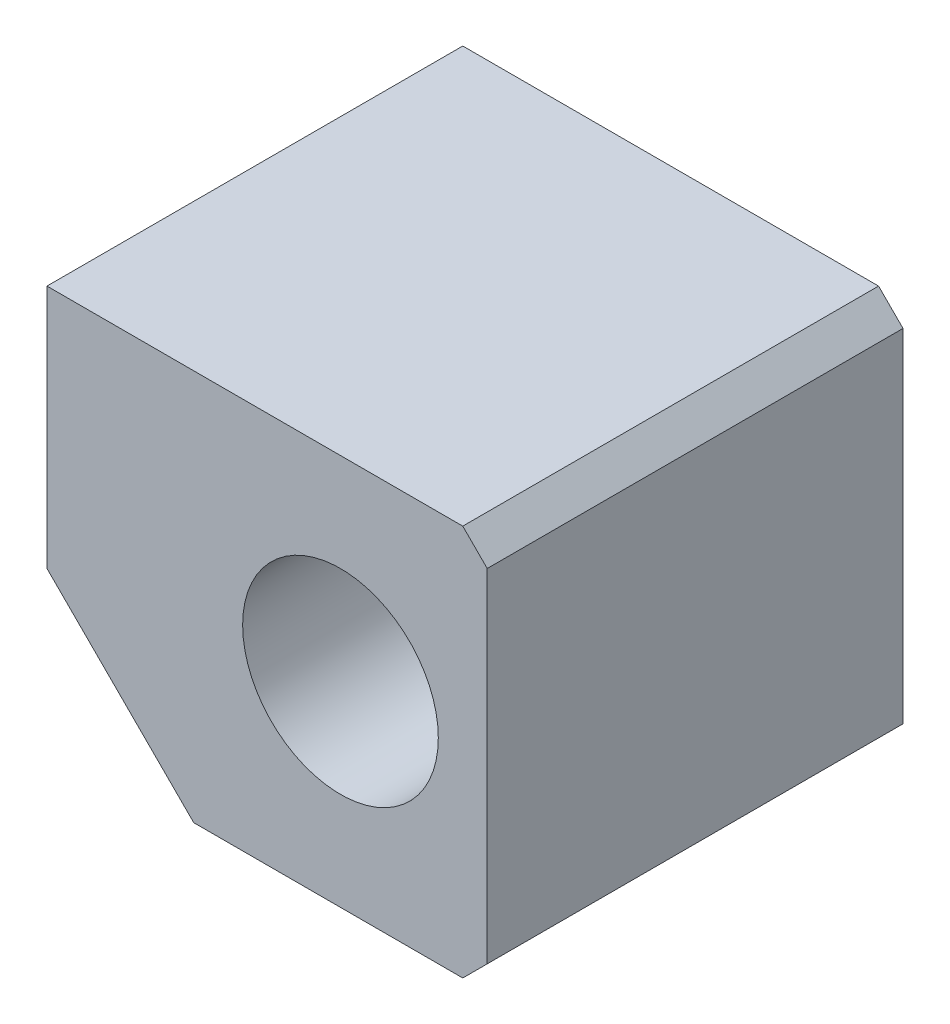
ISO-10303-21;
HEADER;
FILE_DESCRIPTION(('STEP AP214'),'2;1');
FILE_NAME('part.step','',(''),(''),'','','');
FILE_SCHEMA(('AUTOMOTIVE_DESIGN { 1 0 10303 214 1 1 1 1 }'));
ENDSEC;
DATA;
#1=APPLICATION_CONTEXT('core data for automotive mechanical design processes');
#2=APPLICATION_PROTOCOL_DEFINITION('international standard','automotive_design',2000,#1);
#3=PRODUCT_CONTEXT('',#1,'mechanical');
#4=PRODUCT('Part','Part','',(#3));
#5=PRODUCT_RELATED_PRODUCT_CATEGORY('part','',(#4));
#6=PRODUCT_DEFINITION_FORMATION('','',#4);
#7=PRODUCT_DEFINITION_CONTEXT('part definition',#1,'design');
#8=PRODUCT_DEFINITION('design','',#6,#7);
#9=PRODUCT_DEFINITION_SHAPE('','',#8);
#10=(LENGTH_UNIT() NAMED_UNIT(*) SI_UNIT(.MILLI.,.METRE.));
#11=(NAMED_UNIT(*) PLANE_ANGLE_UNIT() SI_UNIT($,.RADIAN.));
#12=(NAMED_UNIT(*) SI_UNIT($,.STERADIAN.) SOLID_ANGLE_UNIT());
#13=UNCERTAINTY_MEASURE_WITH_UNIT(LENGTH_MEASURE(1.E-05),#10,'distance_accuracy_value','');
#14=(GEOMETRIC_REPRESENTATION_CONTEXT(3) GLOBAL_UNCERTAINTY_ASSIGNED_CONTEXT((#13)) GLOBAL_UNIT_ASSIGNED_CONTEXT((#10,
#11,#12)) REPRESENTATION_CONTEXT('',''));
#15=CARTESIAN_POINT('',(0.,0.,0.));
#16=DIRECTION('',(0.,0.,1.));
#17=DIRECTION('',(1.,0.,0.));
#18=AXIS2_PLACEMENT_3D('',#15,#16,#17);
#19=CARTESIAN_POINT('',(40.7365441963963,-61.0198306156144,40.));
#20=DIRECTION('',(0.,1.,0.));
#21=DIRECTION('',(0.,0.,1.));
#22=AXIS2_PLACEMENT_3D('',#19,#20,#21);
#23=CYLINDRICAL_SURFACE('',#22,5.05299999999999);
#24=CARTESIAN_POINT('',(40.7365441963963,-61.0198306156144,40.));
#25=DIRECTION('',(0.,1.,0.));
#26=DIRECTION('',(0.,0.,1.));
#27=AXIS2_PLACEMENT_3D('',#24,#25,#26);
#28=CIRCLE('',#27,5.05299999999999);
#29=CARTESIAN_POINT('',(40.7365441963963,-61.0198306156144,45.053));
#30=VERTEX_POINT('',#29);
#31=EDGE_CURVE('E21',#30,#30,#28,.T.);
#32=ORIENTED_EDGE('',*,*,#31,.F.);
#33=EDGE_LOOP('',(#32));
#34=FACE_BOUND('',#33,.T.);
#35=CARTESIAN_POINT('',(35.6835441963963,-40.3709853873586,40.));
#36=CARTESIAN_POINT('',(35.6835447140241,-40.3709857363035,40.1393591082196));
#37=CARTESIAN_POINT('',(35.6893142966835,-40.3724948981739,40.2787303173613));
#38=CARTESIAN_POINT('',(35.7123485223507,-40.3784875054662,40.5565079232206));
#39=CARTESIAN_POINT('',(35.7296180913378,-40.3829722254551,40.6949138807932));
#40=CARTESIAN_POINT('',(35.7755418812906,-40.3947891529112,40.9699101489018));
#41=CARTESIAN_POINT('',(35.8042127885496,-40.4021255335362,41.1064974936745));
#42=CARTESIAN_POINT('',(35.8727118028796,-40.4194280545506,41.3767283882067));
#43=CARTESIAN_POINT('',(35.9125442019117,-40.4293952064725,41.510370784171));
#44=CARTESIAN_POINT('',(36.0029388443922,-40.4516380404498,41.7734404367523));
#45=CARTESIAN_POINT('',(36.053476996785,-40.463908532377,41.9028764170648));
#46=CARTESIAN_POINT('',(36.1649684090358,-40.490423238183,42.1570274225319));
#47=CARTESIAN_POINT('',(36.225925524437,-40.5046681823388,42.2817406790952));
#48=CARTESIAN_POINT('',(36.357753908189,-40.5347162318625,42.5255084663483));
#49=CARTESIAN_POINT('',(36.4286187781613,-40.5505183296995,42.6445665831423));
#50=CARTESIAN_POINT('',(36.5798276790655,-40.5832580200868,42.8764000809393));
#51=CARTESIAN_POINT('',(36.6601752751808,-40.6001960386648,42.9891730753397));
#52=CARTESIAN_POINT('',(36.8314943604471,-40.635089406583,43.2098750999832));
#53=CARTESIAN_POINT('',(36.9226464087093,-40.6530583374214,43.3176618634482));
#54=CARTESIAN_POINT('',(37.1136608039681,-40.6892018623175,43.5252557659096));
#55=CARTESIAN_POINT('',(37.2135263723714,-40.7073765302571,43.6250599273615));
#56=CARTESIAN_POINT('',(37.4212640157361,-40.7434212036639,43.8159693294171));
#57=CARTESIAN_POINT('',(37.52913436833,-40.7612912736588,43.9070764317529));
#58=CARTESIAN_POINT('',(37.7522414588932,-40.7962481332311,44.0800339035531));
#59=CARTESIAN_POINT('',(37.8674808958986,-40.8133346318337,44.1618808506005));
#60=CARTESIAN_POINT('',(38.10619192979,-40.8464784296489,44.3167787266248));
#61=CARTESIAN_POINT('',(38.2297557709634,-40.862518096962,44.38969139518));
#62=CARTESIAN_POINT('',(38.4828501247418,-40.8928554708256,44.5248496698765));
#63=CARTESIAN_POINT('',(38.6123828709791,-40.9071525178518,44.5870912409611));
#64=CARTESIAN_POINT('',(38.8764143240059,-40.9335818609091,44.7003551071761));
#65=CARTESIAN_POINT('',(39.0109105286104,-40.9457152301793,44.7513829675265));
#66=CARTESIAN_POINT('',(39.2839556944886,-40.9674823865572,44.8418510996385));
#67=CARTESIAN_POINT('',(39.4225060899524,-40.9771152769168,44.8812872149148));
#68=CARTESIAN_POINT('',(39.8368269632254,-41.0014609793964,44.9802206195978));
#69=CARTESIAN_POINT('',(40.117094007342,-41.012220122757,45.0228284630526));
#70=CARTESIAN_POINT('',(40.6808353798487,-41.0217427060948,45.0605933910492));
#71=CARTESIAN_POINT('',(40.9643092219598,-41.0205079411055,45.0557575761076));
#72=CARTESIAN_POINT('',(41.5198069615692,-41.0063745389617,44.9995445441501));
#73=CARTESIAN_POINT('',(41.7919447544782,-40.9937408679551,44.9492245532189));
#74=CARTESIAN_POINT('',(42.3237787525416,-40.9585308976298,44.8051445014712));
#75=CARTESIAN_POINT('',(42.5834742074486,-40.9359539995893,44.7113818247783));
#76=CARTESIAN_POINT('',(43.0858106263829,-40.8829976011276,44.4822670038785));
#77=CARTESIAN_POINT('',(43.3282724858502,-40.8525481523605,44.346539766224));
#78=CARTESIAN_POINT('',(43.7874231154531,-40.7871255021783,44.0375057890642));
#79=CARTESIAN_POINT('',(44.0041090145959,-40.7521517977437,43.8641948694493));
#80=CARTESIAN_POINT('',(44.3082999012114,-40.6985914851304,43.5770959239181));
#81=CARTESIAN_POINT('',(44.4074284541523,-40.6802966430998,43.475285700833));
#82=CARTESIAN_POINT('',(44.596780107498,-40.6439955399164,43.2636656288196));
#83=CARTESIAN_POINT('',(44.6870063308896,-40.6259891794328,43.1538586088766));
#84=CARTESIAN_POINT('',(44.8580104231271,-40.5907568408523,42.9268657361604));
#85=CARTESIAN_POINT('',(44.9387803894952,-40.5735315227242,42.8096738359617));
#86=CARTESIAN_POINT('',(45.0901938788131,-40.5403771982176,42.5688067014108));
#87=CARTESIAN_POINT('',(45.1608413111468,-40.5244476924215,42.4451339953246));
#88=CARTESIAN_POINT('',(45.2919278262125,-40.4942506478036,42.191305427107));
#89=CARTESIAN_POINT('',(45.3523005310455,-40.4799940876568,42.0611139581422));
#90=CARTESIAN_POINT('',(45.4617984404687,-40.4536965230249,41.7959260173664));
#91=CARTESIAN_POINT('',(45.5109281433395,-40.441654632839,41.6609314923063));
#92=CARTESIAN_POINT('',(45.5974906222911,-40.4201704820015,41.3872884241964));
#93=CARTESIAN_POINT('',(45.634942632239,-40.410723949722,41.2486463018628));
#94=CARTESIAN_POINT('',(45.6979210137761,-40.3947060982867,40.9685744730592));
#95=CARTESIAN_POINT('',(45.7234529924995,-40.3881334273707,40.8271461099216));
#96=CARTESIAN_POINT('',(45.7584319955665,-40.3790891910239,40.5714513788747));
#97=CARTESIAN_POINT('',(45.7700926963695,-40.3760558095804,40.4575023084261));
#98=CARTESIAN_POINT('',(45.7856490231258,-40.3720037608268,40.2290382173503));
#99=CARTESIAN_POINT('',(45.7895446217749,-40.370985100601,40.1145231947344));
#100=CARTESIAN_POINT('',(45.7895436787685,-40.3709857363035,39.8606408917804));
#101=CARTESIAN_POINT('',(45.7837740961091,-40.3724948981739,39.7212696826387));
#102=CARTESIAN_POINT('',(45.760739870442,-40.3784875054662,39.4434920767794));
#103=CARTESIAN_POINT('',(45.7434703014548,-40.3829722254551,39.3050861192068));
#104=CARTESIAN_POINT('',(45.697546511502,-40.3947891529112,39.0300898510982));
#105=CARTESIAN_POINT('',(45.668875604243,-40.4021255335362,38.8935025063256));
#106=CARTESIAN_POINT('',(45.600376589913,-40.4194280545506,38.6232716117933));
#107=CARTESIAN_POINT('',(45.5605441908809,-40.4293952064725,38.489629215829));
#108=CARTESIAN_POINT('',(45.4701495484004,-40.4516380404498,38.2265595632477));
#109=CARTESIAN_POINT('',(45.4196113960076,-40.463908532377,38.0971235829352));
#110=CARTESIAN_POINT('',(45.3081199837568,-40.490423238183,37.8429725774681));
#111=CARTESIAN_POINT('',(45.2471628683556,-40.5046681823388,37.7182593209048));
#112=CARTESIAN_POINT('',(45.1153344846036,-40.5347162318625,37.4744915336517));
#113=CARTESIAN_POINT('',(45.0444696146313,-40.5505183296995,37.3554334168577));
#114=CARTESIAN_POINT('',(44.8932607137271,-40.5832580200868,37.1235999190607));
#115=CARTESIAN_POINT('',(44.8129131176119,-40.6001960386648,37.0108269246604));
#116=CARTESIAN_POINT('',(44.6415940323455,-40.635089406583,36.7901249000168));
#117=CARTESIAN_POINT('',(44.5504419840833,-40.6530583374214,36.6823381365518));
#118=CARTESIAN_POINT('',(44.3594275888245,-40.6892018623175,36.4747442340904));
#119=CARTESIAN_POINT('',(44.2595620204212,-40.7073765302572,36.3749400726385));
#120=CARTESIAN_POINT('',(44.0518243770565,-40.7434212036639,36.1840306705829));
#121=CARTESIAN_POINT('',(43.9439540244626,-40.7612912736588,36.0929235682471));
#122=CARTESIAN_POINT('',(43.7208469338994,-40.7962481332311,35.9199660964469));
#123=CARTESIAN_POINT('',(43.605607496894,-40.8133346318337,35.8381191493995));
#124=CARTESIAN_POINT('',(43.3668964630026,-40.8464784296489,35.6832212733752));
#125=CARTESIAN_POINT('',(43.2433326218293,-40.862518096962,35.61030860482));
#126=CARTESIAN_POINT('',(42.9902382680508,-40.8928554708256,35.4751503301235));
#127=CARTESIAN_POINT('',(42.8607055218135,-40.9071525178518,35.412908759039));
#128=CARTESIAN_POINT('',(42.5966740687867,-40.9335818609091,35.2996448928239));
#129=CARTESIAN_POINT('',(42.4621778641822,-40.9457152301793,35.2486170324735));
#130=CARTESIAN_POINT('',(42.189132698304,-40.9674823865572,35.1581489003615));
#131=CARTESIAN_POINT('',(42.0505823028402,-40.9771152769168,35.1187127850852));
#132=CARTESIAN_POINT('',(41.6362614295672,-41.0014609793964,35.0197793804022));
#133=CARTESIAN_POINT('',(41.3559943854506,-41.012220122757,34.9771715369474));
#134=CARTESIAN_POINT('',(40.7922530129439,-41.0217427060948,34.9394066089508));
#135=CARTESIAN_POINT('',(40.5087791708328,-41.0205079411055,34.9442424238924));
#136=CARTESIAN_POINT('',(39.9532814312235,-41.0063745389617,35.0004554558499));
#137=CARTESIAN_POINT('',(39.6811436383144,-40.9937408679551,35.0507754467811));
#138=CARTESIAN_POINT('',(39.149309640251,-40.9585308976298,35.1948554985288));
#139=CARTESIAN_POINT('',(38.889614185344,-40.9359539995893,35.2886181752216));
#140=CARTESIAN_POINT('',(38.3872777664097,-40.8829976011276,35.5177329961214));
#141=CARTESIAN_POINT('',(38.1448159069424,-40.8525481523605,35.653460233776));
#142=CARTESIAN_POINT('',(37.6856652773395,-40.7871255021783,35.9624942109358));
#143=CARTESIAN_POINT('',(37.4689793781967,-40.7521517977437,36.1358051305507));
#144=CARTESIAN_POINT('',(37.1647884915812,-40.6985914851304,36.4229040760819));
#145=CARTESIAN_POINT('',(37.0656599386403,-40.6802966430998,36.524714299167));
#146=CARTESIAN_POINT('',(36.8763082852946,-40.6439955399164,36.7363343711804));
#147=CARTESIAN_POINT('',(36.7860820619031,-40.6259891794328,36.8461413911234));
#148=CARTESIAN_POINT('',(36.6150779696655,-40.5907568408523,37.0731342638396));
#149=CARTESIAN_POINT('',(36.5343080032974,-40.5735315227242,37.1903261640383));
#150=CARTESIAN_POINT('',(36.3828945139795,-40.5403771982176,37.4311932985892));
#151=CARTESIAN_POINT('',(36.3122470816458,-40.5244476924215,37.5548660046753));
#152=CARTESIAN_POINT('',(36.1811605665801,-40.4942506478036,37.808694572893));
#153=CARTESIAN_POINT('',(36.1207878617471,-40.4799940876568,37.9388860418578));
#154=CARTESIAN_POINT('',(36.0112899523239,-40.4536965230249,38.2040739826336));
#155=CARTESIAN_POINT('',(35.9621602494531,-40.441654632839,38.3390685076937));
#156=CARTESIAN_POINT('',(35.8755977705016,-40.4201704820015,38.6127115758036));
#157=CARTESIAN_POINT('',(35.8381457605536,-40.410723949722,38.7513536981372));
#158=CARTESIAN_POINT('',(35.7751673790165,-40.3947060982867,39.0314255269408));
#159=CARTESIAN_POINT('',(35.7496354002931,-40.3881334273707,39.1728538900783));
#160=CARTESIAN_POINT('',(35.7146563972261,-40.3790891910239,39.4285486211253));
#161=CARTESIAN_POINT('',(35.7029956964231,-40.3760558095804,39.5424976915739));
#162=CARTESIAN_POINT('',(35.6874393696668,-40.3720037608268,39.7709617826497));
#163=CARTESIAN_POINT('',(35.6835437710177,-40.370985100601,39.8854768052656));
#164=CARTESIAN_POINT('',(35.6835441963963,-40.3709853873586,40.));
#165=B_SPLINE_CURVE_WITH_KNOTS('',3,(#35,#36,#37,#38,#39,#40,#41,#42,#43,#44,#45,#46,#47,#48,
#49,#50,#51,#52,#53,#54,#55,#56,#57,#58,#59,#60,#61,#62,#63,#64,#65,#66,#67,#68,#69,#70,#71,#72,
#73,#74,#75,#76,#77,#78,#79,#80,#81,#82,#83,#84,#85,#86,#87,#88,#89,#90,#91,#92,#93,#94,#95,#96,
#97,#98,#99,#100,#101,#102,#103,#104,#105,#106,#107,#108,#109,#110,#111,#112,#113,#114,#115,
#116,#117,#118,#119,#120,#121,#122,#123,#124,#125,#126,#127,#128,#129,#130,#131,#132,#133,#134,
#135,#136,#137,#138,#139,#140,#141,#142,#143,#144,#145,#146,#147,#148,#149,#150,#151,#152,#153,
#154,#155,#156,#157,#158,#159,#160,#161,#162,#163,#164),.UNSPECIFIED.,.T.,.F.,(4,2,2,2,2,2,2,2,
2,2,2,2,2,2,2,2,2,2,2,2,2,2,2,2,2,2,2,2,2,2,2,2,2,2,2,2,2,2,2,2,2,2,2,2,2,2,2,2,2,2,2,2,2,2,2,2,
2,2,2,2,2,2,2,2,4),(0.,0.417971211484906,0.836121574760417,1.25488618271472,1.67381204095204,
2.09180502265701,2.50995301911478,2.92783221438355,3.34586902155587,3.77227899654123,
4.19884728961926,4.62532406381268,5.05195794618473,5.48452905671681,5.91726337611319,
6.34978244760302,6.78245642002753,7.62896869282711,8.47535427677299,9.30255868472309,
10.1298129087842,10.9646863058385,11.7996526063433,12.2290508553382,12.6582979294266,
13.0879011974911,13.5173381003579,13.949451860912,14.3813924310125,14.8126177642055,
15.2436400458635,15.5871212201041,15.9306036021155,16.3485748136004,16.7667251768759,
17.1854897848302,17.6044156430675,18.0224086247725,18.4405566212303,18.858435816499,
19.2764726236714,19.7028825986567,20.1294508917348,20.5559276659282,20.9825615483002,
21.4151326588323,21.8478669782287,22.2803860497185,22.713060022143,23.5595722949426,
24.4059578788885,25.2331622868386,26.0604165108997,26.895289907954,27.7302562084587,
28.1596544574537,28.5889015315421,29.0185047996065,29.4479417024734,29.8800554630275,
30.311996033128,30.743221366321,31.1742436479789,31.5177248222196,31.861207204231),.UNSPECIFIED.);
#166=CARTESIAN_POINT('',(35.6835441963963,-40.3709853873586,40.));
#167=VERTEX_POINT('',#166);
#168=EDGE_CURVE('E142',#167,#167,#165,.T.);
#169=ORIENTED_EDGE('',*,*,#168,.T.);
#170=EDGE_LOOP('',(#169));
#171=FACE_BOUND('',#170,.T.);
#172=ADVANCED_FACE('F16',(#34,#171),#23,.F.);
#173=CARTESIAN_POINT('',(-4.26345580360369,-46.0198306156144,0.));
#174=DIRECTION('',(-0.707106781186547,-0.707106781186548,0.));
#175=DIRECTION('',(0.707106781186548,-0.707106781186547,0.));
#176=AXIS2_PLACEMENT_3D('',#173,#174,#175);
#177=PLANE('',#176);
#178=DIRECTION('',(0.707106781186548,-0.707106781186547,0.));
#179=VECTOR('',#178,1.);
#180=CARTESIAN_POINT('',(-19.2634558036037,-31.0198306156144,0.));
#181=LINE('',#180,#179);
#182=CARTESIAN_POINT('',(-19.2634558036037,-31.0198306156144,0.));
#183=VERTEX_POINT('',#182);
#184=CARTESIAN_POINT('',(10.7365441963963,-61.0198306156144,0.));
#185=VERTEX_POINT('',#184);
#186=EDGE_CURVE('E92',#183,#185,#181,.T.);
#187=ORIENTED_EDGE('',*,*,#186,.T.);
#188=DIRECTION('',(0.,0.,-1.));
#189=VECTOR('',#188,1.);
#190=CARTESIAN_POINT('',(10.7365441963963,-61.0198306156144,0.));
#191=LINE('',#190,#189);
#192=CARTESIAN_POINT('',(10.7365441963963,-61.0198306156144,85.));
#193=VERTEX_POINT('',#192);
#194=EDGE_CURVE('E95',#193,#185,#191,.T.);
#195=ORIENTED_EDGE('',*,*,#194,.F.);
#196=DIRECTION('',(0.707106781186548,-0.707106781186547,0.));
#197=VECTOR('',#196,1.);
#198=CARTESIAN_POINT('',(-19.2634558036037,-31.0198306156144,85.));
#199=LINE('',#198,#197);
#200=CARTESIAN_POINT('',(-19.2634558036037,-31.0198306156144,85.));
#201=VERTEX_POINT('',#200);
#202=EDGE_CURVE('E128',#201,#193,#199,.T.);
#203=ORIENTED_EDGE('',*,*,#202,.F.);
#204=DIRECTION('',(0.,0.,1.));
#205=VECTOR('',#204,1.);
#206=CARTESIAN_POINT('',(-19.2634558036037,-31.0198306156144,0.));
#207=LINE('',#206,#205);
#208=EDGE_CURVE('E72',#183,#201,#207,.T.);
#209=ORIENTED_EDGE('',*,*,#208,.F.);
#210=EDGE_LOOP('',(#187,#195,#203,#209));
#211=FACE_BOUND('',#210,.T.);
#212=ADVANCED_FACE('F94',(#211),#177,.T.);
#213=CARTESIAN_POINT('',(70.7365441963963,-61.0198306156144,0.));
#214=DIRECTION('',(0.,-1.,0.));
#215=DIRECTION('',(0.,0.,-1.));
#216=AXIS2_PLACEMENT_3D('',#213,#214,#215);
#217=PLANE('',#216);
#218=ORIENTED_EDGE('',*,*,#31,.T.);
#219=EDGE_LOOP('',(#218));
#220=FACE_BOUND('',#219,.T.);
#221=DIRECTION('',(0.,0.,1.));
#222=VECTOR('',#221,1.);
#223=CARTESIAN_POINT('',(65.7365441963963,-61.0198306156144,0.));
#224=LINE('',#223,#222);
#225=CARTESIAN_POINT('',(65.7365441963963,-61.0198306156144,85.));
#226=VERTEX_POINT('',#225);
#227=CARTESIAN_POINT('',(65.7365441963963,-61.0198306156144,0.));
#228=VERTEX_POINT('',#227);
#229=EDGE_CURVE('E192',#226,#228,#224,.F.);
#230=ORIENTED_EDGE('',*,*,#229,.F.);
#231=DIRECTION('',(1.,0.,0.));
#232=VECTOR('',#231,1.);
#233=CARTESIAN_POINT('',(25.7365441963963,-61.0198306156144,85.));
#234=LINE('',#233,#232);
#235=EDGE_CURVE('E105',#193,#226,#234,.T.);
#236=ORIENTED_EDGE('',*,*,#235,.F.);
#237=ORIENTED_EDGE('',*,*,#194,.T.);
#238=DIRECTION('',(1.,0.,0.));
#239=VECTOR('',#238,1.);
#240=CARTESIAN_POINT('',(25.7365441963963,-61.0198306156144,0.));
#241=LINE('',#240,#239);
#242=EDGE_CURVE('E99',#185,#228,#241,.T.);
#243=ORIENTED_EDGE('',*,*,#242,.T.);
#244=EDGE_LOOP('',(#230,#236,#237,#243));
#245=FACE_BOUND('',#244,.T.);
#246=ADVANCED_FACE('F102',(#220,#245),#217,.T.);
#247=CARTESIAN_POINT('',(68.2365441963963,-58.5198306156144,0.));
#248=DIRECTION('',(0.707106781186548,-0.707106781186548,0.));
#249=DIRECTION('',(0.707106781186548,0.707106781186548,0.));
#250=AXIS2_PLACEMENT_3D('',#247,#248,#249);
#251=PLANE('',#250);
#252=DIRECTION('',(0.707106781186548,0.707106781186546,0.));
#253=VECTOR('',#252,1.);
#254=CARTESIAN_POINT('',(65.7365441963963,-61.0198306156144,0.));
#255=LINE('',#254,#253);
#256=CARTESIAN_POINT('',(70.7365441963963,-56.0198306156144,0.));
#257=VERTEX_POINT('',#256);
#258=EDGE_CURVE('E110',#228,#257,#255,.T.);
#259=ORIENTED_EDGE('',*,*,#258,.T.);
#260=DIRECTION('',(0.,0.,-1.));
#261=VECTOR('',#260,1.);
#262=CARTESIAN_POINT('',(70.7365441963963,-56.0198306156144,0.));
#263=LINE('',#262,#261);
#264=CARTESIAN_POINT('',(70.7365441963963,-56.0198306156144,85.));
#265=VERTEX_POINT('',#264);
#266=EDGE_CURVE('E59',#265,#257,#263,.T.);
#267=ORIENTED_EDGE('',*,*,#266,.F.);
#268=DIRECTION('',(0.707106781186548,0.707106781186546,0.));
#269=VECTOR('',#268,1.);
#270=CARTESIAN_POINT('',(65.7365441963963,-61.0198306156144,85.));
#271=LINE('',#270,#269);
#272=EDGE_CURVE('E124',#226,#265,#271,.T.);
#273=ORIENTED_EDGE('',*,*,#272,.F.);
#274=ORIENTED_EDGE('',*,*,#229,.T.);
#275=EDGE_LOOP('',(#259,#267,#273,#274));
#276=FACE_BOUND('',#275,.T.);
#277=ADVANCED_FACE('F170',(#276),#251,.T.);
#278=CARTESIAN_POINT('',(70.7365441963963,18.9801693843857,0.));
#279=DIRECTION('',(1.,0.,0.));
#280=DIRECTION('',(0.,0.,-1.));
#281=AXIS2_PLACEMENT_3D('',#278,#279,#280);
#282=PLANE('',#281);
#283=ORIENTED_EDGE('',*,*,#266,.T.);
#284=DIRECTION('',(0.,1.,0.));
#285=VECTOR('',#284,1.);
#286=CARTESIAN_POINT('',(70.7365441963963,-21.0198306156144,0.));
#287=LINE('',#286,#285);
#288=CARTESIAN_POINT('',(70.7365441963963,13.9801693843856,0.));
#289=VERTEX_POINT('',#288);
#290=EDGE_CURVE('E86',#257,#289,#287,.T.);
#291=ORIENTED_EDGE('',*,*,#290,.T.);
#292=DIRECTION('',(0.,0.,1.));
#293=VECTOR('',#292,1.);
#294=CARTESIAN_POINT('',(70.7365441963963,13.9801693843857,0.));
#295=LINE('',#294,#293);
#296=CARTESIAN_POINT('',(70.7365441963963,13.9801693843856,85.));
#297=VERTEX_POINT('',#296);
#298=EDGE_CURVE('E78',#297,#289,#295,.F.);
#299=ORIENTED_EDGE('',*,*,#298,.F.);
#300=DIRECTION('',(0.,1.,0.));
#301=VECTOR('',#300,1.);
#302=CARTESIAN_POINT('',(70.7365441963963,-21.0198306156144,85.));
#303=LINE('',#302,#301);
#304=EDGE_CURVE('E120',#265,#297,#303,.T.);
#305=ORIENTED_EDGE('',*,*,#304,.F.);
#306=EDGE_LOOP('',(#283,#291,#299,#305));
#307=FACE_BOUND('',#306,.T.);
#308=ADVANCED_FACE('F167',(#307),#282,.T.);
#309=CARTESIAN_POINT('',(40.7365441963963,-21.0198306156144,85.));
#310=DIRECTION('',(0.,0.,-1.));
#311=DIRECTION('',(-1.,0.,0.));
#312=AXIS2_PLACEMENT_3D('',#309,#310,#311);
#313=CYLINDRICAL_SURFACE('',#312,20.);
#314=CARTESIAN_POINT('',(40.7365441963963,-21.0198306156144,85.));
#315=DIRECTION('',(0.,0.,-1.));
#316=DIRECTION('',(-1.,0.,0.));
#317=AXIS2_PLACEMENT_3D('',#314,#315,#316);
#318=CIRCLE('',#317,20.);
#319=CARTESIAN_POINT('',(20.7365441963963,-21.0198306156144,85.));
#320=VERTEX_POINT('',#319);
#321=EDGE_CURVE('E123',#320,#320,#318,.T.);
#322=ORIENTED_EDGE('',*,*,#321,.F.);
#323=EDGE_LOOP('',(#322));
#324=FACE_BOUND('',#323,.T.);
#325=CARTESIAN_POINT('',(40.7365441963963,-21.0198306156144,0.));
#326=DIRECTION('',(0.,0.,-1.));
#327=DIRECTION('',(-1.,0.,0.));
#328=AXIS2_PLACEMENT_3D('',#325,#326,#327);
#329=CIRCLE('',#328,20.);
#330=CARTESIAN_POINT('',(20.7365441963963,-21.0198306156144,0.));
#331=VERTEX_POINT('',#330);
#332=EDGE_CURVE('E119',#331,#331,#329,.T.);
#333=ORIENTED_EDGE('',*,*,#332,.T.);
#334=EDGE_LOOP('',(#333));
#335=FACE_BOUND('',#334,.T.);
#336=ORIENTED_EDGE('',*,*,#168,.F.);
#337=EDGE_LOOP('',(#336));
#338=FACE_BOUND('',#337,.T.);
#339=ADVANCED_FACE('F18',(#324,#335,#338),#313,.F.);
#340=CARTESIAN_POINT('',(68.2365441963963,16.4801693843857,0.));
#341=DIRECTION('',(0.707106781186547,0.707106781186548,0.));
#342=DIRECTION('',(-0.707106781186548,0.707106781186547,0.));
#343=AXIS2_PLACEMENT_3D('',#340,#341,#342);
#344=PLANE('',#343);
#345=DIRECTION('',(-0.707106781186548,0.707106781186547,0.));
#346=VECTOR('',#345,1.);
#347=CARTESIAN_POINT('',(70.7365441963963,13.9801693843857,0.));
#348=LINE('',#347,#346);
#349=CARTESIAN_POINT('',(65.7365441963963,18.9801693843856,0.));
#350=VERTEX_POINT('',#349);
#351=EDGE_CURVE('E141',#289,#350,#348,.T.);
#352=ORIENTED_EDGE('',*,*,#351,.T.);
#353=DIRECTION('',(0.,0.,1.));
#354=VECTOR('',#353,1.);
#355=CARTESIAN_POINT('',(65.7365441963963,18.9801693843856,0.));
#356=LINE('',#355,#354);
#357=CARTESIAN_POINT('',(65.7365441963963,18.9801693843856,85.));
#358=VERTEX_POINT('',#357);
#359=EDGE_CURVE('E50',#358,#350,#356,.F.);
#360=ORIENTED_EDGE('',*,*,#359,.F.);
#361=DIRECTION('',(-0.707106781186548,0.707106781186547,0.));
#362=VECTOR('',#361,1.);
#363=CARTESIAN_POINT('',(70.7365441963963,13.9801693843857,85.));
#364=LINE('',#363,#362);
#365=EDGE_CURVE('E117',#297,#358,#364,.T.);
#366=ORIENTED_EDGE('',*,*,#365,.F.);
#367=ORIENTED_EDGE('',*,*,#298,.T.);
#368=EDGE_LOOP('',(#352,#360,#366,#367));
#369=FACE_BOUND('',#368,.T.);
#370=ADVANCED_FACE('F163',(#369),#344,.T.);
#371=CARTESIAN_POINT('',(25.7365441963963,-21.0198306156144,0.));
#372=DIRECTION('',(0.,0.,1.));
#373=DIRECTION('',(1.,0.,0.));
#374=AXIS2_PLACEMENT_3D('',#371,#372,#373);
#375=PLANE('',#374);
#376=ORIENTED_EDGE('',*,*,#332,.F.);
#377=EDGE_LOOP('',(#376));
#378=FACE_BOUND('',#377,.T.);
#379=ORIENTED_EDGE('',*,*,#290,.F.);
#380=ORIENTED_EDGE('',*,*,#258,.F.);
#381=ORIENTED_EDGE('',*,*,#242,.F.);
#382=ORIENTED_EDGE('',*,*,#186,.F.);
#383=DIRECTION('',(0.,1.,0.));
#384=VECTOR('',#383,1.);
#385=CARTESIAN_POINT('',(-19.2634558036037,-61.0198306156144,0.));
#386=LINE('',#385,#384);
#387=CARTESIAN_POINT('',(-19.2634558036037,18.9801693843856,0.));
#388=VERTEX_POINT('',#387);
#389=EDGE_CURVE('E115',#388,#183,#386,.F.);
#390=ORIENTED_EDGE('',*,*,#389,.F.);
#391=DIRECTION('',(1.,0.,0.));
#392=VECTOR('',#391,1.);
#393=CARTESIAN_POINT('',(-19.2634558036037,18.9801693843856,0.));
#394=LINE('',#393,#392);
#395=EDGE_CURVE('E134',#350,#388,#394,.F.);
#396=ORIENTED_EDGE('',*,*,#395,.F.);
#397=ORIENTED_EDGE('',*,*,#351,.F.);
#398=EDGE_LOOP('',(#379,#380,#381,#382,#390,#396,#397));
#399=FACE_BOUND('',#398,.T.);
#400=ADVANCED_FACE('F109',(#378,#399),#375,.F.);
#401=CARTESIAN_POINT('',(-19.2634558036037,-61.0198306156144,0.));
#402=DIRECTION('',(-1.,0.,0.));
#403=DIRECTION('',(0.,0.,1.));
#404=AXIS2_PLACEMENT_3D('',#401,#402,#403);
#405=PLANE('',#404);
#406=DIRECTION('',(0.,0.,1.));
#407=VECTOR('',#406,1.);
#408=CARTESIAN_POINT('',(-19.2634558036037,18.9801693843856,0.));
#409=LINE('',#408,#407);
#410=CARTESIAN_POINT('',(-19.2634558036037,18.9801693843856,85.));
#411=VERTEX_POINT('',#410);
#412=EDGE_CURVE('E27',#388,#411,#409,.T.);
#413=ORIENTED_EDGE('',*,*,#412,.F.);
#414=ORIENTED_EDGE('',*,*,#389,.T.);
#415=ORIENTED_EDGE('',*,*,#208,.T.);
#416=DIRECTION('',(0.,1.,0.));
#417=VECTOR('',#416,1.);
#418=CARTESIAN_POINT('',(-19.2634558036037,-21.0198306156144,85.));
#419=LINE('',#418,#417);
#420=EDGE_CURVE('E36',#411,#201,#419,.F.);
#421=ORIENTED_EDGE('',*,*,#420,.F.);
#422=EDGE_LOOP('',(#413,#414,#415,#421));
#423=FACE_BOUND('',#422,.T.);
#424=ADVANCED_FACE('F157',(#423),#405,.T.);
#425=CARTESIAN_POINT('',(25.7365441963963,-21.0198306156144,85.));
#426=DIRECTION('',(0.,0.,1.));
#427=DIRECTION('',(1.,0.,0.));
#428=AXIS2_PLACEMENT_3D('',#425,#426,#427);
#429=PLANE('',#428);
#430=ORIENTED_EDGE('',*,*,#321,.T.);
#431=EDGE_LOOP('',(#430));
#432=FACE_BOUND('',#431,.T.);
#433=ORIENTED_EDGE('',*,*,#272,.T.);
#434=ORIENTED_EDGE('',*,*,#304,.T.);
#435=ORIENTED_EDGE('',*,*,#365,.T.);
#436=DIRECTION('',(1.,0.,0.));
#437=VECTOR('',#436,1.);
#438=CARTESIAN_POINT('',(-19.2634558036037,18.9801693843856,85.));
#439=LINE('',#438,#437);
#440=EDGE_CURVE('E10',#411,#358,#439,.T.);
#441=ORIENTED_EDGE('',*,*,#440,.F.);
#442=ORIENTED_EDGE('',*,*,#420,.T.);
#443=ORIENTED_EDGE('',*,*,#202,.T.);
#444=ORIENTED_EDGE('',*,*,#235,.T.);
#445=EDGE_LOOP('',(#433,#434,#435,#441,#442,#443,#444));
#446=FACE_BOUND('',#445,.T.);
#447=ADVANCED_FACE('F153',(#432,#446),#429,.T.);
#448=CARTESIAN_POINT('',(-19.2634558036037,18.9801693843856,0.));
#449=DIRECTION('',(0.,1.,0.));
#450=DIRECTION('',(0.,0.,1.));
#451=AXIS2_PLACEMENT_3D('',#448,#449,#450);
#452=PLANE('',#451);
#453=ORIENTED_EDGE('',*,*,#412,.T.);
#454=ORIENTED_EDGE('',*,*,#440,.T.);
#455=ORIENTED_EDGE('',*,*,#359,.T.);
#456=ORIENTED_EDGE('',*,*,#395,.T.);
#457=EDGE_LOOP('',(#453,#454,#455,#456));
#458=FACE_BOUND('',#457,.T.);
#459=ADVANCED_FACE('F150',(#458),#452,.T.);
#460=CLOSED_SHELL('',(#172,#212,#246,#277,#308,#339,#370,#400,#424,#447,#459));
#461=MANIFOLD_SOLID_BREP('B1',#460);
#462=ADVANCED_BREP_SHAPE_REPRESENTATION('',(#18,#461),#14);
#463=SHAPE_DEFINITION_REPRESENTATION(#9,#462);
ENDSEC;
END-ISO-10303-21;
